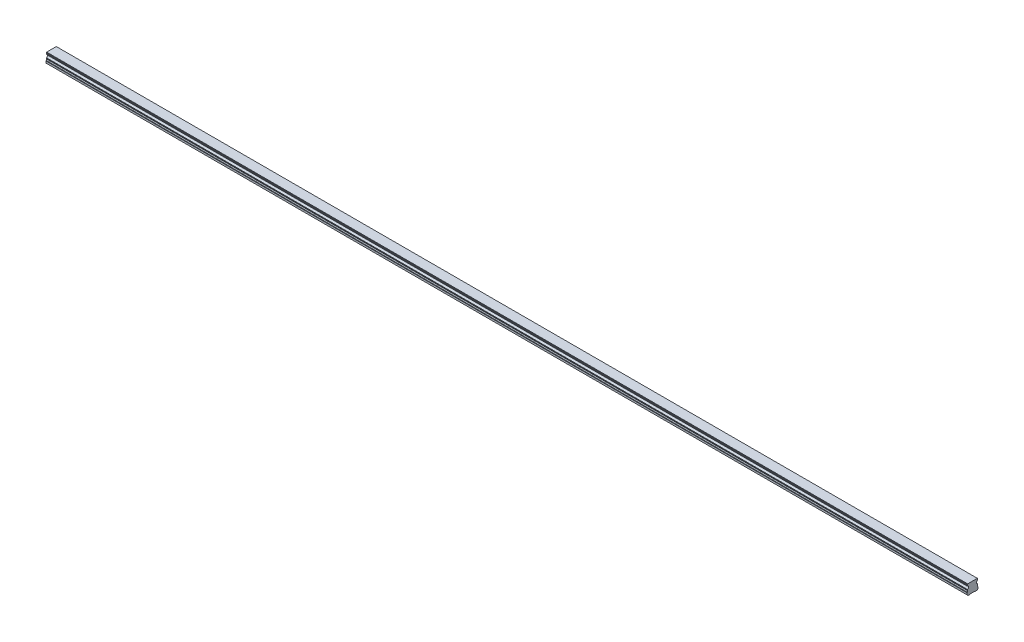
from build123d import *

# Parameters (mm, degrees)
BOSS_EXTRUDE1_DEPTH        = 1260
SKETCH3_R                  = 2.5
SKETCH3_R_2                = 2.1
CUT_EXTRUDE3_DEPTH         = 7
SKETCH3_2_R                = 2.1
CUT_EXTRUDE4_DEPTH         = 9.5
CHAMFER1_SIZE              = 0.4
LPATTERN2_COUNT            = 21
LPATTERN2_PITCH            = 60
CHAMFER1_OF_LPATTERN2_SIZE = 0.4


with BuildPart() as part:
    # Sketch1 → Boss-Extrude1 (new body)
    with BuildSketch(Plane(origin=(0, 0, 0), x_dir=(0, 0, -1), z_dir=(1, 0, 0))):
        with BuildLine():
            Line((6.59, 14), (-6.59, 14))
            Line((-6.59, 14), (-6.59, 13.15))
            Line((-6.59, 13.15), (-6.96, 12.356532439))
            Line((-6.96, 12.356532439), (-6.96, 11.435174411))
            ThreePointArc((-6.96, 11.435174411), (-5.25, 9.5), (-6.96, 7.564825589))
            Line((-6.96, 7.564825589), (-6.96, 6.643467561))
            Line((-6.96, 6.643467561), (-6.59, 5.85))
            Line((-6.59, 5.85), (-7.032116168, 4.2))
            Line((-7.032116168, 4.2), (-7.5, 3.929867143))
            Line((-7.5, 3.929867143), (-7.5, 1.4))
            Line((-7.5, 1.4), (-6.1, 0))
            Line((-6.1, 0), (-3.65, 0))
            Line((-3.65, 0), (-3.25, 0.4))
            Line((-3.25, 0.4), (3.25, 0.4))
            Line((3.25, 0.4), (3.65, 0))
            Line((3.65, 0), (6.1, 0))
            Line((6.1, 0), (7.5, 1.4))
            Line((7.5, 1.4), (7.5, 3.929867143))
            Line((7.5, 3.929867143), (7.032116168, 4.2))
            Line((7.032116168, 4.2), (6.59, 5.85))
            Line((6.59, 5.85), (6.96, 6.643467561))
            Line((6.96, 6.643467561), (6.96, 7.564825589))
            ThreePointArc((6.96, 7.564825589), (5.25, 9.5), (6.96, 11.435174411))
            Line((6.96, 11.435174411), (6.96, 12.356532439))
            Line((6.96, 12.356532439), (6.59, 13.15))
            Line((6.59, 13.15), (6.59, 14))
        make_face()
    extrude(amount=BOSS_EXTRUDE1_DEPTH)

    # Sketch3 → Cut-Extrude3 (cut)
    with BuildSketch(Plane.XZ):
        with Locations(Location((30, 0, 0), (0, 0, 270))):
            Circle(SKETCH3_R)
        with Locations(Location((30, 0, 0), (0, 0, 270))):
            Circle(SKETCH3_R_2, mode=Mode.SUBTRACT)
    cut_extrude3 = extrude(amount=-CUT_EXTRUDE3_DEPTH, mode=Mode.SUBTRACT)

    # Sketch3_2 → Cut-Extrude4 (cut)
    with BuildSketch(Plane.XZ):
        with Locations(Location((30, 0, 0), (0, 0, 270))):
            Circle(SKETCH3_2_R)
    cut_extrude4 = extrude(amount=-CUT_EXTRUDE4_DEPTH, mode=Mode.SUBTRACT)

    # Cut-Extrude5 cone 1 section (on through the dimple's axis) → Cut-Extrude5 (revolve, cut)
    with BuildSketch(Plane(origin=(30, 9.5, 0), x_dir=(0, 0, -1), z_dir=(1, 0, 0))):
        Polygon((0, 0), (2.1, 0), (0, 1.212435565), align=None)
    revolve(axis=Axis((30, 9.5, 0), (0, 1, 0)), mode=Mode.SUBTRACT)

    # Chamfer1
    chamfer1_edges = [part.edges().sort_by_distance(p)[0] for p in [
        (30, 0.4, 2.5),
    ]]
    chamfer(chamfer1_edges, length=CHAMFER1_SIZE)

    # LPattern2: Cut-Extrude3, Cut-Extrude4 ×21
    with Locations(*[(i * LPATTERN2_PITCH, 0, 0) for i in range(1, LPATTERN2_COUNT)]):
        add(cut_extrude3, mode=Mode.SUBTRACT)
        add(cut_extrude4, mode=Mode.SUBTRACT)

    # Chamfer1 of LPattern2
    chamfer1_of_lpattern2_edges = [part.edges().sort_by_distance(p)[0] for p in [
        (90, 0.4, 2.5),
        (150, 0.4, 2.5),
        (210, 0.4, 2.5),
        (270, 0.4, 2.5),
        (330, 0.4, 2.5),
        (390, 0.4, 2.5),
        (450, 0.4, 2.5),
        (510, 0.4, 2.5),
        (570, 0.4, 2.5),
        (630, 0.4, 2.5),
        (690, 0.4, 2.5),
        (750, 0.4, 2.5),
        (810, 0.4, 2.5),
        (870, 0.4, 2.5),
        (930, 0.4, 2.5),
        (990, 0.4, 2.5),
        (1050, 0.4, 2.5),
        (1110, 0.4, 2.5),
        (1170, 0.4, 2.5),
        (1230, 0.4, 2.5),
    ]]
    chamfer(chamfer1_of_lpattern2_edges, length=CHAMFER1_OF_LPATTERN2_SIZE)


solid = part.part
